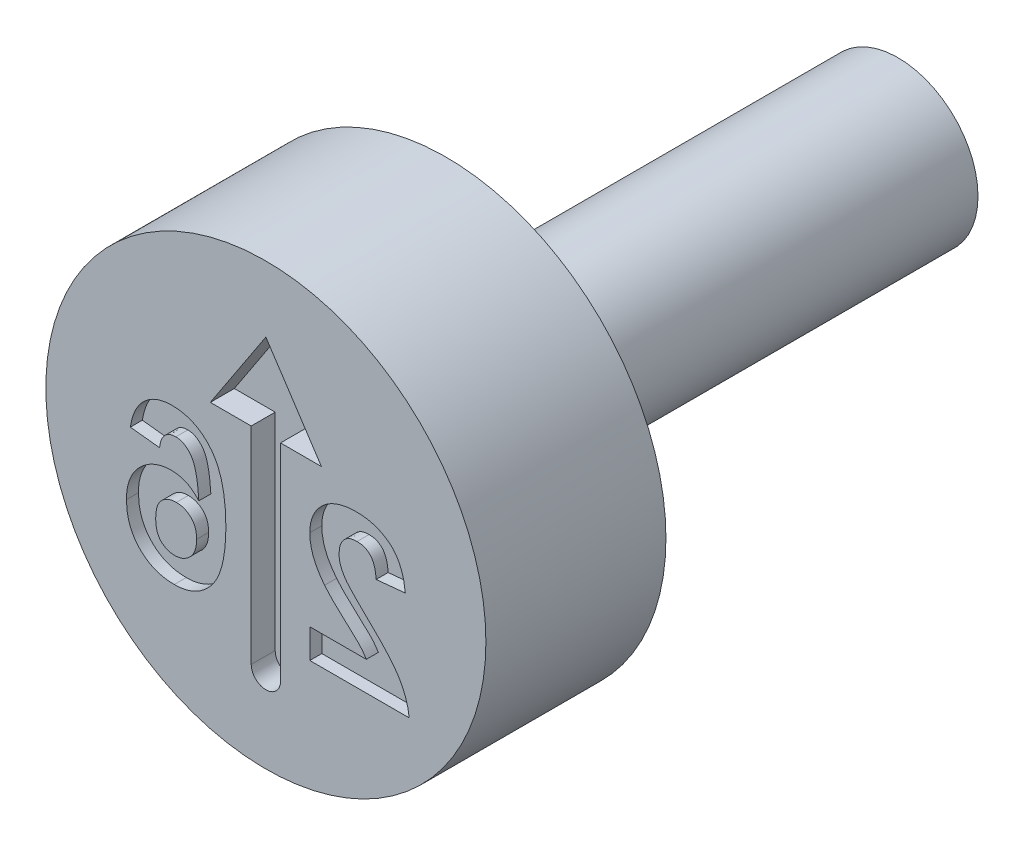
from build123d import *

# Parameters (mm, degrees)
CUT_EXTRUDE4_DEPTH = 0.6
CUT_EXTRUDE5_DEPTH = 0.3


with BuildPart() as part:
    # Sketch2 → Revolve1 (revolve)
    with BuildSketch(Plane(origin=(0, 0, 0), x_dir=(0, 0, -1), z_dir=(1, 0, 0)), mode=Mode.PRIVATE) as revolve1_sk:
        Polygon((0, 5.5), (0, 0), (15.8, 0), (15.8, 2), (4.5, 2), (4.5, 5.5), align=None)
    revolve(revolve1_sk.sketch.rotate(Axis((0, 0, -0.403888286), (0, 0, -1)), 90), axis=Axis((0, 0, -0.403888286), (0, 0, -1)))

    # Sketch3 → Cut-Extrude4 (cut)
    with BuildSketch(Plane.XY):
        with BuildLine():
            Line((0.366422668, 1.743593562), (0.366422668, -3.416891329))
            ThreePointArc((0.366422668, -3.416891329), (0, -3.783313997), (-0.366422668, -3.416891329))
            Line((-0.366422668, -3.416891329), (-0.366422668, 1.743593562))
            Line((-0.366422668, 1.743593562), (-1.388789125, 1.743593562))
            Line((-1.388789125, 1.743593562), (0, 3.851569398))
            Line((0, 3.851569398), (1.388789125, 1.743593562))
            Line((1.388789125, 1.743593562), (0.366422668, 1.743593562))
        make_face()
    extrude(amount=-CUT_EXTRUDE4_DEPTH, mode=Mode.SUBTRACT)

    # Sketch4 → Cut-Extrude5 (cut)
    # profile 1 of 2: a face of its own
    with BuildSketch(Plane.XY):
        with BuildLine():
            Line((1.098762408, -1.869230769), (1.098762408, -2.6))
            Line((1.098762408, -2.6), (3.583377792, -2.6))
            add(Edge.make_bspline(
                [(3.583377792, -2.6), (3.57496546, -2.537545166), (3.558145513, -2.412670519), (3.50614425, -2.230260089), (3.436740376, -2.052258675), (3.361415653, -1.907408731), (3.286496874, -1.79080951), (3.21852306, -1.695267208), (3.137432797, -1.593614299), (3.044402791, -1.485030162), (2.939947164, -1.369175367), (2.823286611, -1.246480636), (2.693864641, -1.117533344), (2.60281398, -1.029971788), (2.555733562, -0.984695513)],
                knots=[0, 0, 0, 0, 1.156289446, 2.311930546, 3.473459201, 4.661751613, 5.303057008, 6.018253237, 6.81459331, 7.690699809, 8.644447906, 9.679642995, 10.800191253, 12, 12, 12, 12], degree=3))
            add(Edge.make_bspline(
                [(2.555733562, -0.984695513), (2.518162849, -0.948429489), (2.446639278, -0.879389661), (2.344789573, -0.780527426), (2.255253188, -0.689644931), (2.17615804, -0.609097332), (2.109331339, -0.536833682), (2.053894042, -0.473988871), (2.009144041, -0.420306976), (1.984907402, -0.386251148), (1.974163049, -0.371153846)],
                knots=[0, 0, 0, 0, 1.480720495, 2.818855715, 4.024636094, 5.098235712, 6.019786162, 6.815086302, 7.474715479, 8, 8, 8, 8], degree=3))
            add(Edge.make_bspline(
                [(1.974163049, -0.371153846), (1.952161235, -0.334606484), (1.909722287, -0.264110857), (1.863184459, -0.153255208), (1.83525072, -0.042422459), (1.831417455, 0.031635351), (1.829531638, 0.06806891)],
                knots=[0, 0, 0, 0, 1.0911822, 2.104764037, 3.067617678, 4, 4, 4, 4], degree=3))
            add(Edge.make_bspline(
                [(1.829531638, 0.06806891), (1.830900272, 0.105982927), (1.833489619, 0.17771329), (1.855201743, 0.278938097), (1.893704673, 0.365955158), (1.946716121, 0.439031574), (2.013749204, 0.496286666), (2.092112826, 0.538592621), (2.182954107, 0.561982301), (2.246802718, 0.565058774), (2.280172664, 0.566666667)],
                knots=[0, 0, 0, 0, 1.193122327, 2.257294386, 3.237245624, 4.168877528, 5.075331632, 5.990371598, 6.949684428, 8, 8, 8, 8], degree=3))
            add(Edge.make_bspline(
                [(2.280172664, 0.566666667), (2.313317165, 0.565165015), (2.377345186, 0.562264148), (2.468342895, 0.53692257), (2.547949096, 0.493053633), (2.604680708, 0.443060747), (2.643005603, 0.394446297), (2.66911885, 0.352082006), (2.69162643, 0.30394318), (2.711570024, 0.250571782), (2.727323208, 0.191356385), (2.740009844, 0.126747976), (2.750233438, 0.056398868), (2.753484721, 0.007459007), (2.755172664, -0.017948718)],
                knots=[0, 0, 0, 0, 1.402788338, 2.709884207, 3.961032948, 5.225417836, 5.883680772, 6.578928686, 7.329201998, 8.132101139, 8.990263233, 9.922304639, 10.921339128, 12, 12, 12, 12], degree=3))
            Line((2.755172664, -0.017948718), (3.485941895, 0.053605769))
            add(Edge.make_bspline(
                [(3.485941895, 0.053605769), (3.480066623, 0.102941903), (3.468675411, 0.198596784), (3.440248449, 0.335990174), (3.404246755, 0.462741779), (3.358954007, 0.578616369), (3.306242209, 0.684350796), (3.243422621, 0.778358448), (3.172690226, 0.861680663), (3.093983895, 0.934273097), (3.007803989, 0.996366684), (2.917373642, 1.051794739), (2.820925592, 1.097263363), (2.719521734, 1.134736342), (2.613207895, 1.164684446), (2.501492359, 1.184485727), (2.385064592, 1.198414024), (2.305590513, 1.199463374), (2.264948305, 1.2)],
                knots=[0, 0, 0, 0, 1.270971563, 2.464210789, 3.586263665, 4.638946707, 5.643716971, 6.603612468, 7.52484387, 8.434700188, 9.336036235, 10.239171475, 11.145359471, 12.059630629, 13.003312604, 13.96741569, 14.960557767, 16, 16, 16, 16], degree=3))
            add(Edge.make_bspline(
                [(2.264948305, 1.2), (2.220764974, 1.199150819), (2.13471239, 1.197496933), (2.009090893, 1.18383913), (1.891078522, 1.160024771), (1.779643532, 1.128479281), (1.675930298, 1.086363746), (1.579074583, 1.035447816), (1.490600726, 0.973799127), (1.409189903, 0.904779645), (1.336415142, 0.828880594), (1.272671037, 0.747921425), (1.219266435, 0.66195854), (1.174451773, 0.572039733), (1.141177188, 0.47671808), (1.116931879, 0.377311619), (1.100856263, 0.273356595), (1.099468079, 0.202357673), (1.098762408, 0.166266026)],
                knots=[0, 0, 0, 0, 1.210756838, 2.35810096, 3.457354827, 4.507168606, 5.527358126, 6.519769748, 7.499700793, 8.476517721, 9.440526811, 10.376769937, 11.295256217, 12.209626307, 13.124630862, 14.055668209, 15.011616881, 16, 16, 16, 16], degree=3))
            add(Edge.make_bspline(
                [(1.098762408, 0.166266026), (1.09969212, 0.124844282), (1.101536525, 0.042669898), (1.119195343, -0.07880839), (1.146174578, -0.197485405), (1.186047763, -0.313651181), (1.23659012, -0.430092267), (1.30174043, -0.547070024), (1.377384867, -0.668112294), (1.436611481, -0.746371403), (1.467191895, -0.786778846)],
                knots=[0, 0, 0, 0, 0.953409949, 1.89141903, 2.821310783, 3.752688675, 4.715703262, 5.740811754, 6.833515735, 8, 8, 8, 8], degree=3))
            add(Edge.make_bspline(
                [(1.467191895, -0.786778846), (1.478749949, -0.801336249), (1.503504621, -0.832514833), (1.545618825, -0.880322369), (1.594425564, -0.932543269), (1.649235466, -0.990154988), (1.711859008, -1.051117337), (1.780042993, -1.117979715), (1.856787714, -1.187321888), (1.936276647, -1.260873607), (2.016111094, -1.33246046), (2.089490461, -1.400452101), (2.156143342, -1.460610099), (2.212965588, -1.516255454), (2.263299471, -1.563590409), (2.305330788, -1.605042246), (2.339846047, -1.63960745), (2.387405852, -1.693485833), (2.447920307, -1.766356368), (2.4904947, -1.835986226), (2.510821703, -1.869230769)],
                knots=[0, 0, 0, 0, 0.665555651, 1.425465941, 2.280616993, 3.225313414, 4.272635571, 5.410053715, 6.644756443, 7.976022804, 9.288331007, 10.484517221, 11.558462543, 12.503158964, 13.33222979, 14.032602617, 14.617328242, 15.080653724, 16.606167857, 18, 18, 18, 18], degree=3))
            Line((2.510821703, -1.869230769), (1.098762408, -1.869230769))
        make_face()
    # profile 2 of 2: a face of its own
    with BuildSketch(Plane.XY):
        with BuildLine():
            Line((-3.38718631, 0.208133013), (-2.656417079, 0.128205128))
            add(Edge.make_bspline(
                [(-2.656417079, 0.128205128), (-2.651521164, 0.163402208), (-2.642307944, 0.229636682), (-2.615018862, 0.321040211), (-2.577029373, 0.397933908), (-2.52826618, 0.460425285), (-2.47018408, 0.508521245), (-2.404002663, 0.542696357), (-2.329763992, 0.562983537), (-2.277714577, 0.565407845), (-2.250687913, 0.566666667)],
                knots=[0, 0, 0, 0, 1.280716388, 2.410074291, 3.425374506, 4.35753932, 5.248331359, 6.12451615, 7.026154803, 8, 8, 8, 8], degree=3))
            add(Edge.make_bspline(
                [(-2.250687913, 0.566666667), (-2.232360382, 0.566218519), (-2.195889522, 0.565326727), (-2.142765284, 0.554004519), (-2.091547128, 0.537202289), (-2.042653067, 0.513405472), (-1.995839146, 0.482700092), (-1.951817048, 0.444719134), (-1.908562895, 0.401464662), (-1.868622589, 0.349232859), (-1.830304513, 0.28738674), (-1.797311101, 0.211675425), (-1.76790405, 0.122169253), (-1.742725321, 0.018429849), (-1.719875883, -0.098884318), (-1.701145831, -0.230248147), (-1.686158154, -0.375779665), (-1.678967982, -0.477699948), (-1.675207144, -0.531009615)],
                knots=[0, 0, 0, 0, 0.642458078, 1.278459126, 1.898279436, 2.531842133, 3.181731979, 3.858193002, 4.57010051, 5.325711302, 6.161524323, 7.118599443, 8.217371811, 9.466325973, 10.864147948, 12.412648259, 14.123626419, 16, 16, 16, 16], degree=3))
            add(Edge.make_bspline(
                [(-1.675207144, -0.531009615), (-1.698562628, -0.505642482), (-1.744360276, -0.455900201), (-1.820353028, -0.391047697), (-1.899966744, -0.335603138), (-1.984067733, -0.290115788), (-2.073115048, -0.256265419), (-2.165495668, -0.230563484), (-2.262418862, -0.216166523), (-2.328287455, -0.213949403), (-2.361825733, -0.212820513)],
                knots=[0, 0, 0, 0, 1.057745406, 2.074127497, 3.059409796, 4.031705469, 5.000875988, 5.977809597, 6.970362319, 8, 8, 8, 8], degree=3))
            add(Edge.make_bspline(
                [(-2.361825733, -0.212820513), (-2.399676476, -0.213910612), (-2.474418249, -0.216063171), (-2.584530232, -0.23116078), (-2.690189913, -0.258308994), (-2.791875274, -0.295033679), (-2.890088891, -0.341279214), (-2.98295204, -0.399819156), (-3.071922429, -0.4680741), (-3.155776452, -0.546054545), (-3.232818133, -0.631904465), (-3.300838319, -0.724629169), (-3.356816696, -0.824511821), (-3.404671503, -0.929316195), (-3.440277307, -1.041111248), (-3.466123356, -1.158288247), (-3.481551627, -1.281922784), (-3.483582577, -1.366275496), (-3.484622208, -1.409455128)],
                knots=[0, 0, 0, 0, 0.99135015, 1.957564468, 2.903754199, 3.843479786, 4.78583385, 5.741106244, 6.712813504, 7.719198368, 8.735844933, 9.730198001, 10.724351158, 11.729813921, 12.742848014, 13.790983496, 14.86921809, 16, 16, 16, 16], degree=3))
            add(Edge.make_bspline(
                [(-3.484622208, -1.409455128), (-3.483567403, -1.455166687), (-3.481510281, -1.544315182), (-3.466368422, -1.67487526), (-3.439621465, -1.798109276), (-3.403079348, -1.91500594), (-3.355813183, -2.024638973), (-3.298554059, -2.127911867), (-3.229364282, -2.223059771), (-3.151383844, -2.311362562), (-3.064451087, -2.390161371), (-2.971805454, -2.459938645), (-2.872419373, -2.517942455), (-2.767761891, -2.566762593), (-2.656035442, -2.602590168), (-2.539209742, -2.629459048), (-2.416334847, -2.645846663), (-2.332442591, -2.647745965), (-2.289510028, -2.648717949)],
                knots=[0, 0, 0, 0, 1.13287417, 2.209376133, 3.25169942, 4.254157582, 5.240146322, 6.205890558, 7.174579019, 8.150183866, 9.1206468, 10.07783463, 11.019441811, 11.967766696, 12.934309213, 13.921380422, 14.936249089, 16, 16, 16, 16], degree=3))
            add(Edge.make_bspline(
                [(-2.289510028, -2.648717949), (-2.243508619, -2.647430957), (-2.153061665, -2.644900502), (-2.020657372, -2.624076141), (-1.894778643, -2.588844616), (-1.775441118, -2.539642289), (-1.661652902, -2.477753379), (-1.554470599, -2.40087607), (-1.45417824, -2.309743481), (-1.359449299, -2.205589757), (-1.2732485, -2.085283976), (-1.199839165, -1.946235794), (-1.137580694, -1.789968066), (-1.086893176, -1.616080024), (-1.047766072, -1.424585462), (-1.020464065, -1.215468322), (-1.002329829, -0.989074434), (-1.000799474, -0.832236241), (-1.000006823, -0.751001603)],
                knots=[0, 0, 0, 0, 0.852151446, 1.675481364, 2.476404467, 3.269281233, 4.062617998, 4.871616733, 5.707301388, 6.56955125, 7.476395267, 8.442009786, 9.475854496, 10.58877921, 11.794095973, 13.094195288, 14.494932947, 16, 16, 16, 16], degree=3))
            add(Edge.make_bspline(
                [(-1.000006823, -0.751001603), (-1.001142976, -0.667741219), (-1.003338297, -0.506862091), (-1.021003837, -0.274574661), (-1.04906399, -0.060067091), (-1.089940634, 0.136176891), (-1.14222502, 0.314564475), (-1.205611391, 0.475454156), (-1.281692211, 0.618263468), (-1.37014807, 0.742527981), (-1.467475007, 0.850546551), (-1.572053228, 0.943784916), (-1.68348349, 1.02314466), (-1.801763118, 1.088425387), (-1.927863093, 1.13791434), (-2.060587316, 1.173651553), (-2.200158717, 1.196619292), (-2.29576292, 1.19886133), (-2.344317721, 1.2)],
                knots=[0, 0, 0, 0, 1.491699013, 2.882321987, 4.171520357, 5.365488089, 6.470299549, 7.49861535, 8.458736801, 9.361983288, 10.224742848, 11.058789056, 11.867429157, 12.671146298, 13.473202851, 14.288259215, 15.130652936, 16, 16, 16, 16], degree=3))
            add(Edge.make_bspline(
                [(-2.344317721, 1.2), (-2.378613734, 1.199382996), (-2.445658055, 1.198176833), (-2.543921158, 1.185368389), (-2.637663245, 1.165782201), (-2.727130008, 1.138670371), (-2.811691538, 1.102362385), (-2.89168363, 1.058130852), (-2.967375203, 1.006095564), (-3.038372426, 0.946591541), (-3.104103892, 0.879438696), (-3.163457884, 0.804485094), (-3.216827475, 0.722635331), (-3.264446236, 0.633957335), (-3.304388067, 0.537601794), (-3.338724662, 0.434326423), (-3.366964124, 0.323909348), (-3.380342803, 0.247313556), (-3.38718631, 0.208133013)],
                knots=[0, 0, 0, 0, 1.036027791, 2.025301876, 2.989435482, 3.928225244, 4.845595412, 5.765526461, 6.686607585, 7.61747015, 8.561102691, 9.521661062, 10.50224679, 11.510949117, 12.559251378, 13.650572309, 14.798212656, 16, 16, 16, 16], degree=3))
        make_face()
        with BuildLine():
            add(Edge.make_bspline(
                [(-1.730776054, -1.392708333), (-1.731053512, -1.416842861), (-1.73159565, -1.464000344), (-1.740485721, -1.532429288), (-1.753264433, -1.596580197), (-1.77047665, -1.656809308), (-1.794333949, -1.712205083), (-1.822638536, -1.763878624), (-1.856118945, -1.81136171), (-1.907490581, -1.867073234), (-1.97847638, -1.925587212), (-2.071634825, -1.977693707), (-2.171451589, -2.010083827), (-2.240301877, -2.013606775), (-2.275046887, -2.015384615)],
                knots=[0, 0, 0, 0, 0.93816693, 1.833124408, 2.679057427, 3.481731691, 4.264557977, 5.020023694, 5.770442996, 6.518065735, 7.962605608, 9.32780964, 10.651490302, 12, 12, 12, 12], degree=3))
            add(Edge.make_bspline(
                [(-2.275046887, -2.015384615), (-2.307961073, -2.013907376), (-2.372024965, -2.011032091), (-2.463509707, -1.984754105), (-2.546609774, -1.943311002), (-2.607528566, -1.894656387), (-2.650005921, -1.847333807), (-2.678549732, -1.805833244), (-2.701784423, -1.758491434), (-2.720779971, -1.70608808), (-2.736080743, -1.648825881), (-2.746527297, -1.586129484), (-2.75245272, -1.518170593), (-2.753375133, -1.471125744), (-2.753852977, -1.446754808)],
                knots=[0, 0, 0, 0, 1.399678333, 2.724321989, 4.020062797, 5.33532049, 6.016755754, 6.724441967, 7.473839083, 8.257094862, 9.096253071, 9.995581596, 10.961638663, 12, 12, 12, 12], degree=3))
            add(Edge.make_bspline(
                [(-2.753852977, -1.446754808), (-2.75344538, -1.421618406), (-2.752657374, -1.373022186), (-2.745761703, -1.302784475), (-2.734480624, -1.237852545), (-2.718708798, -1.177767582), (-2.697359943, -1.123333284), (-2.672173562, -1.073451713), (-2.641595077, -1.02947551), (-2.596150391, -0.977753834), (-2.53007206, -0.925637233), (-2.441778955, -0.878167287), (-2.342811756, -0.851256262), (-2.273934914, -0.847886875), (-2.238508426, -0.846153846)],
                knots=[0, 0, 0, 0, 1.008384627, 1.949510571, 2.828269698, 3.650667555, 4.437180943, 5.170285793, 5.887596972, 6.580056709, 7.926803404, 9.238379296, 10.579573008, 12, 12, 12, 12], degree=3))
            add(Edge.make_bspline(
                [(-2.238508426, -0.846153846), (-2.204064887, -0.847556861), (-2.137170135, -0.850281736), (-2.041034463, -0.877645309), (-1.95306933, -0.921185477), (-1.888277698, -0.972336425), (-1.842611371, -1.020544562), (-1.81270191, -1.061590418), (-1.786667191, -1.106278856), (-1.766106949, -1.155765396), (-1.75025532, -1.209121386), (-1.738885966, -1.266711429), (-1.732005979, -1.328344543), (-1.731193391, -1.370868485), (-1.730776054, -1.392708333)],
                knots=[0, 0, 0, 0, 1.469034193, 2.853094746, 4.235454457, 5.641396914, 6.354997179, 7.06867986, 7.807229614, 8.560602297, 9.353235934, 10.182779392, 11.06669468, 12, 12, 12, 12], degree=3))
        make_face(mode=Mode.SUBTRACT)
    extrude(amount=-CUT_EXTRUDE5_DEPTH, mode=Mode.SUBTRACT)


solid = part.part
